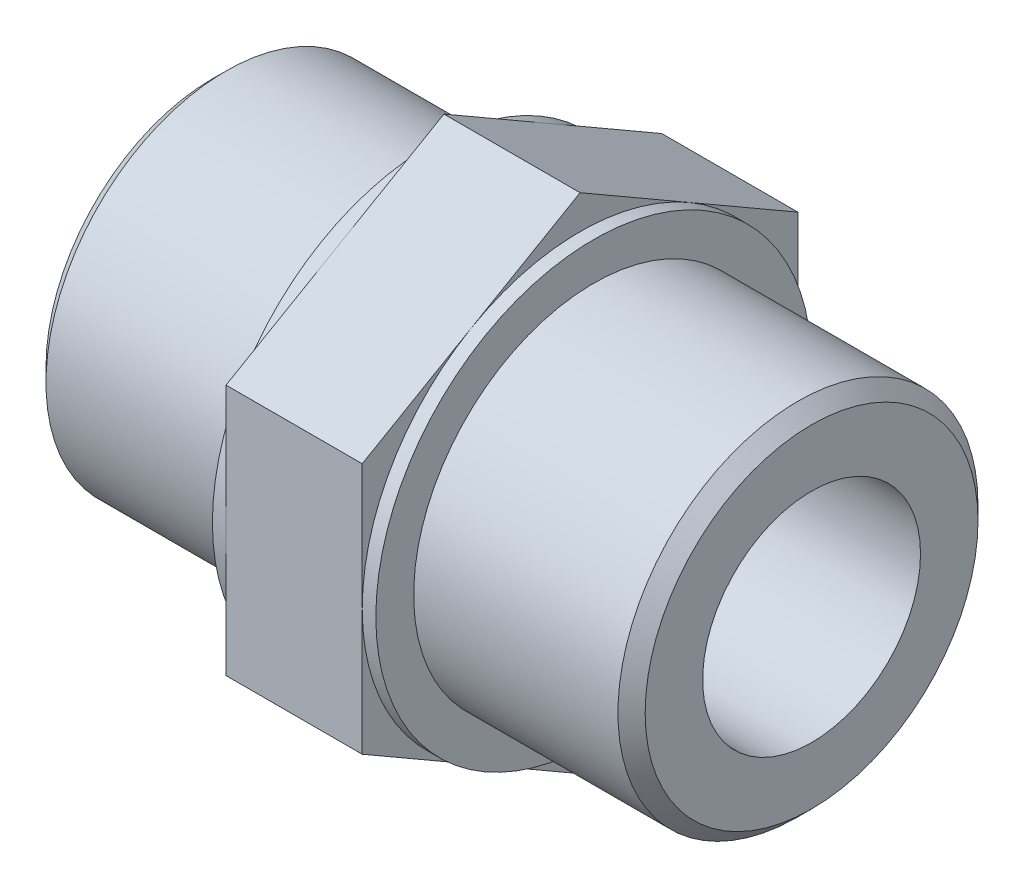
from build123d import *

# Parameters (mm, degrees)
ESQUISSE3_OUTSIDE_W = 52.612
ESQUISSE3_OUTSIDE_H = 52.612
SIX_PANS_DEPTH      = 38.571947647
CHANFREIN1_SIZE     = 1
CHANFREIN2_SIZE     = 1


with BuildPart() as part:
    # Esquisse1 → profil (revolve)
    with BuildSketch(Plane.XY, mode=Mode.PRIVATE) as profil_sk:
        Polygon((-63.444351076, 8), (-63.444351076, 13.2205), (-47.444351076, 13.2205), (-47.444351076, 16), (-46.444351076, 16), (-46.444351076, 18.475), (-36.444351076, 18.475), (-36.444351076, 16), (-35.444351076, 16), (-35.444351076, 13.2205), (-19.444351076, 13.2205), (-19.444351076, 8), align=None)
    revolve(profil_sk.sketch.rotate(Axis((0, 0, 0), (-1, 0, 0)), 90), axis=Axis((0, 0, 0), (-1, 0, 0)))

    # Esquisse3 outside → six pans (cut, through all)
    with BuildSketch(Plane(origin=(-36.444351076, 0, 0), x_dir=(0, 0, -1), z_dir=(1, 0, 0))):
        Rectangle(ESQUISSE3_OUTSIDE_W, ESQUISSE3_OUTSIDE_H)
        Polygon((0, 18.475208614), (-16, 9.237604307), (-16, -9.237604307), (0, -18.475208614), (16, -9.237604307), (16, 9.237604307), align=None, mode=Mode.SUBTRACT)
    extrude(amount=-SIX_PANS_DEPTH, mode=Mode.SUBTRACT)

    # Chanfrein1
    chanfrein1_edges = [part.edges().sort_by_distance(p)[0] for p in [
        (-19.444351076, 0, 13.2205),
    ]]
    chamfer(chanfrein1_edges, length=CHANFREIN1_SIZE)

    # Chanfrein2
    chanfrein2_edges = [part.edges().sort_by_distance(p)[0] for p in [
        (-63.444351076, 0, 13.2205),
    ]]
    chamfer(chanfrein2_edges, length=CHANFREIN2_SIZE)


solid = part.part
